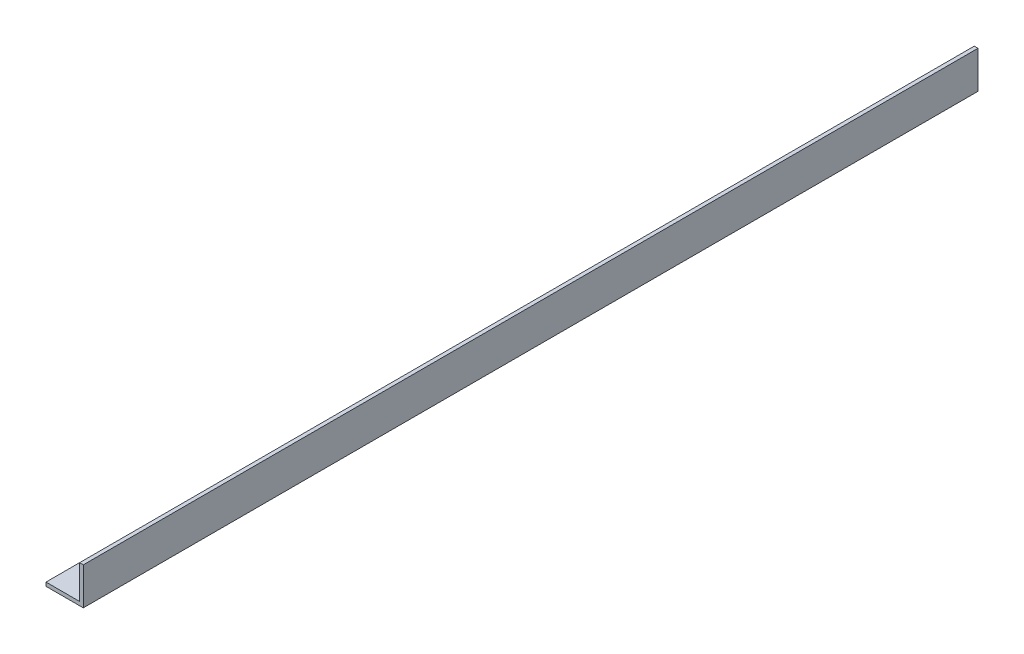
from build123d import *

# Parameters (mm, degrees)
BASE_EXTRUSION_DEPTH = 1200


with BuildPart() as part:
    # Esquisse1 → Base-Extrusion (new body)
    with BuildSketch(Plane.XY):
        Polygon((1451.555845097, 1963.4055144), (1496.555845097, 1963.4055144), (1496.555845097, 2008.4055144), (1501.555845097, 2008.4055144), (1501.555845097, 1958.4055144), (1451.555845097, 1958.4055144), align=None)
    extrude(amount=-BASE_EXTRUSION_DEPTH)


solid = part.part
